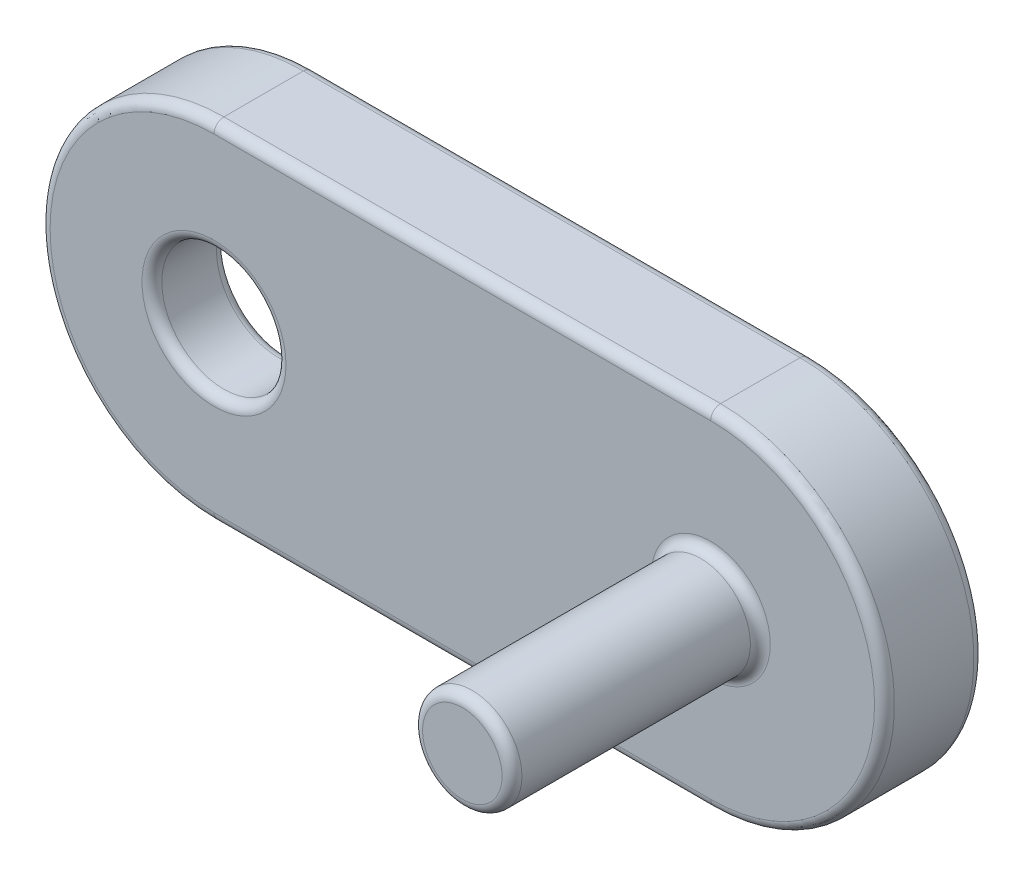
from build123d import *

# Parameters (mm, degrees)
EXTRUSION1_DEPTH        = 2
ENL_V_MAT_EXTRU_1_DEPTH = 0.5
ESQUISSE3_R             = 1.25
ENL_V_MAT_EXTRU_2_DEPTH = 10.313968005
ESQUISSE4_R             = 1
EXTRUSION2_DEPTH        = 5
CONG_1_R                = 0.2


with BuildPart() as part:
    # Esquisse1 → Extrusion1 (new body)
    with BuildSketch(Plane.XY):
        with BuildLine():
            Line((-5, 3.5), (5, 3.5))
            ThreePointArc((5, 3.5), (8.5, 0), (5, -3.5))
            Line((5, -3.5), (-5, -3.5))
            ThreePointArc((-5, -3.5), (-8.5, 0), (-5, 3.5))
        make_face()
    extrude(amount=EXTRUSION1_DEPTH)

    # Esquisse2 → Enl_v. mat.-Extru.1 (cut)
    with BuildSketch(Plane(origin=(0, 0, 0), x_dir=(-1, 0, 0), z_dir=(0, 0, -1))):
        with BuildLine():
            Line((5, 3), (-5, 3))
            ThreePointArc((-5, 3), (-8, 0), (-5, -3))
            Line((-5, -3), (5, -3))
            ThreePointArc((5, -3), (8, 0), (5, 3))
        make_face()
    extrude(amount=-ENL_V_MAT_EXTRU_1_DEPTH, mode=Mode.SUBTRACT)

    # Esquisse3 → Enl_v. mat.-Extru.2 (cut, through all)
    with BuildSketch(Plane(origin=(0, 0, 0.5), x_dir=(-1, 0, 0), z_dir=(0, 0, -1))):
        with Locations((5, 0)):
            Circle(ESQUISSE3_R)
    extrude(amount=-ENL_V_MAT_EXTRU_2_DEPTH, mode=Mode.SUBTRACT)

    # Esquisse4 → Extrusion2 (add)
    with BuildSketch(Plane.XY.offset(2)):
        with Locations((5, 0)):
            Circle(ESQUISSE4_R)
    extrude(amount=EXTRUSION2_DEPTH)

    # Cong_1
    cong_1_edges = [part.edges().sort_by_distance(p)[0] for p in [
        (0, 3.5, 0),
        (0, 3.5, 2),
        (-8.5, 0, 0),
        (-8.5, 0, 2),
        (8.5, 0, 0),
        (8.5, 0, 2),
        (0, -3.5, 0),
        (0, 3, 0),
        (8, 0, 0),
        (0, -3, 0),
        (-8, 0, 0),
        (0, -3.5, 2),
        (4, 0, 2),
        (-3.75, 0, 2),
        (0, 3, 0.5),
        (8, 0, 0.5),
        (0, -3, 0.5),
        (-8, 0, 0.5),
        (4, 0, 7),
        (-3.75, 0, 0.5),
    ]]
    fillet(cong_1_edges, radius=CONG_1_R)


solid = part.part
